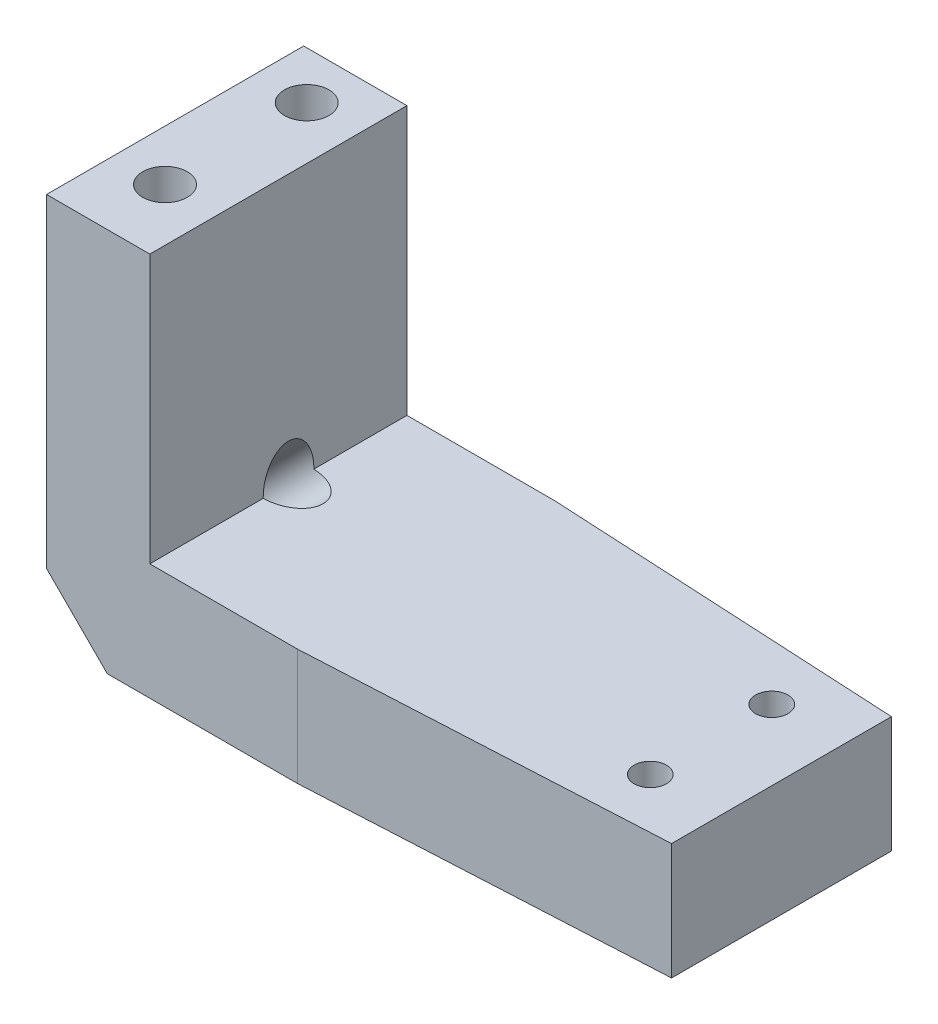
ISO-10303-21;
HEADER;
FILE_DESCRIPTION(('STEP AP214'),'2;1');
FILE_NAME('part.step','',(''),(''),'','','');
FILE_SCHEMA(('AUTOMOTIVE_DESIGN { 1 0 10303 214 1 1 1 1 }'));
ENDSEC;
DATA;
#1=APPLICATION_CONTEXT('core data for automotive mechanical design processes');
#2=APPLICATION_PROTOCOL_DEFINITION('international standard','automotive_design',2000,#1);
#3=PRODUCT_CONTEXT('',#1,'mechanical');
#4=PRODUCT('Part','Part','',(#3));
#5=PRODUCT_RELATED_PRODUCT_CATEGORY('part','',(#4));
#6=PRODUCT_DEFINITION_FORMATION('','',#4);
#7=PRODUCT_DEFINITION_CONTEXT('part definition',#1,'design');
#8=PRODUCT_DEFINITION('design','',#6,#7);
#9=PRODUCT_DEFINITION_SHAPE('','',#8);
#10=(LENGTH_UNIT() NAMED_UNIT(*) SI_UNIT(.MILLI.,.METRE.));
#11=(NAMED_UNIT(*) PLANE_ANGLE_UNIT() SI_UNIT($,.RADIAN.));
#12=(NAMED_UNIT(*) SI_UNIT($,.STERADIAN.) SOLID_ANGLE_UNIT());
#13=UNCERTAINTY_MEASURE_WITH_UNIT(LENGTH_MEASURE(1.E-05),#10,'distance_accuracy_value','');
#14=(GEOMETRIC_REPRESENTATION_CONTEXT(3) GLOBAL_UNCERTAINTY_ASSIGNED_CONTEXT((#13)) GLOBAL_UNIT_ASSIGNED_CONTEXT((#10,
#11,#12)) REPRESENTATION_CONTEXT('',''));
#15=CARTESIAN_POINT('',(0.,0.,0.));
#16=DIRECTION('',(0.,0.,1.));
#17=DIRECTION('',(1.,0.,0.));
#18=AXIS2_PLACEMENT_3D('',#15,#16,#17);
#19=CARTESIAN_POINT('',(29.95,19.,-5.43038701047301));
#20=DIRECTION('',(-0.0523359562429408,0.,0.998629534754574));
#21=DIRECTION('',(0.998629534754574,0.,0.0523359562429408));
#22=AXIS2_PLACEMENT_3D('',#19,#20,#21);
#23=PLANE('',#22);
#24=DIRECTION('',(-0.998629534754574,0.,-0.0523359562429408));
#25=VECTOR('',#24,1.);
#26=CARTESIAN_POINT('',(29.95,0.,-5.43038701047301));
#27=LINE('',#26,#25);
#28=CARTESIAN_POINT('',(29.95,0.,-5.43038701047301));
#29=VERTEX_POINT('',#28);
#30=CARTESIAN_POINT('',(12.402738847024,0.,-6.35));
#31=VERTEX_POINT('',#30);
#32=EDGE_CURVE('E158',#29,#31,#27,.T.);
#33=ORIENTED_EDGE('',*,*,#32,.T.);
#34=DIRECTION('',(0.,-1.,0.));
#35=VECTOR('',#34,1.);
#36=CARTESIAN_POINT('',(12.402738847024,19.,-6.35));
#37=LINE('',#36,#35);
#38=CARTESIAN_POINT('',(12.402738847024,5.75,-6.35));
#39=VERTEX_POINT('',#38);
#40=EDGE_CURVE('E131',#39,#31,#37,.T.);
#41=ORIENTED_EDGE('',*,*,#40,.F.);
#42=DIRECTION('',(0.998629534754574,0.,0.0523359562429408));
#43=VECTOR('',#42,1.);
#44=CARTESIAN_POINT('',(29.95,5.75,-5.43038701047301));
#45=LINE('',#44,#43);
#46=CARTESIAN_POINT('',(29.95,5.75,-5.43038701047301));
#47=VERTEX_POINT('',#46);
#48=EDGE_CURVE('E156',#39,#47,#45,.T.);
#49=ORIENTED_EDGE('',*,*,#48,.T.);
#50=DIRECTION('',(0.,-1.,0.));
#51=VECTOR('',#50,1.);
#52=CARTESIAN_POINT('',(29.95,19.,-5.43038701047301));
#53=LINE('',#52,#51);
#54=EDGE_CURVE('E146',#47,#29,#53,.T.);
#55=ORIENTED_EDGE('',*,*,#54,.T.);
#56=EDGE_LOOP('',(#33,#41,#49,#55));
#57=FACE_BOUND('',#56,.T.);
#58=ADVANCED_FACE('F36',(#57),#23,.F.);
#59=CARTESIAN_POINT('',(0.,19.,-7.));
#60=DIRECTION('',(1.,0.,0.));
#61=DIRECTION('',(0.,0.,-1.));
#62=AXIS2_PLACEMENT_3D('',#59,#60,#61);
#63=PLANE('',#62);
#64=DIRECTION('',(0.,0.,1.));
#65=VECTOR('',#64,1.);
#66=CARTESIAN_POINT('',(0.,19.,-7.));
#67=LINE('',#66,#65);
#68=CARTESIAN_POINT('',(0.,19.,-6.35));
#69=VERTEX_POINT('',#68);
#70=CARTESIAN_POINT('',(0.,19.,6.35));
#71=VERTEX_POINT('',#70);
#72=EDGE_CURVE('E139',#69,#71,#67,.T.);
#73=ORIENTED_EDGE('',*,*,#72,.F.);
#74=DIRECTION('',(0.,-1.,0.));
#75=VECTOR('',#74,1.);
#76=CARTESIAN_POINT('',(0.,19.,-6.35));
#77=LINE('',#76,#75);
#78=CARTESIAN_POINT('',(0.,3.,-6.35));
#79=VERTEX_POINT('',#78);
#80=EDGE_CURVE('E122',#69,#79,#77,.T.);
#81=ORIENTED_EDGE('',*,*,#80,.T.);
#82=DIRECTION('',(0.,0.,1.));
#83=VECTOR('',#82,1.);
#84=CARTESIAN_POINT('',(0.,3.,-7.));
#85=LINE('',#84,#83);
#86=CARTESIAN_POINT('',(0.,3.,6.35));
#87=VERTEX_POINT('',#86);
#88=EDGE_CURVE('E165',#79,#87,#85,.T.);
#89=ORIENTED_EDGE('',*,*,#88,.T.);
#90=DIRECTION('',(0.,-1.,0.));
#91=VECTOR('',#90,1.);
#92=CARTESIAN_POINT('',(0.,19.,6.35));
#93=LINE('',#92,#91);
#94=EDGE_CURVE('E58',#71,#87,#93,.T.);
#95=ORIENTED_EDGE('',*,*,#94,.F.);
#96=EDGE_LOOP('',(#73,#81,#89,#95));
#97=FACE_BOUND('',#96,.T.);
#98=ADVANCED_FACE('F145',(#97),#63,.F.);
#99=CARTESIAN_POINT('',(0.,19.,7.));
#100=DIRECTION('',(-0.0523359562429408,0.,-0.998629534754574));
#101=DIRECTION('',(-0.998629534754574,0.,0.0523359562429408));
#102=AXIS2_PLACEMENT_3D('',#99,#100,#101);
#103=PLANE('',#102);
#104=DIRECTION('',(-0.998629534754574,0.,0.0523359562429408));
#105=VECTOR('',#104,1.);
#106=CARTESIAN_POINT('',(0.,5.75,7.));
#107=LINE('',#106,#105);
#108=CARTESIAN_POINT('',(29.95,5.75,5.43038701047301));
#109=VERTEX_POINT('',#108);
#110=CARTESIAN_POINT('',(12.402738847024,5.75,6.35));
#111=VERTEX_POINT('',#110);
#112=EDGE_CURVE('E229',#109,#111,#107,.T.);
#113=ORIENTED_EDGE('',*,*,#112,.T.);
#114=DIRECTION('',(0.,-1.,0.));
#115=VECTOR('',#114,1.);
#116=CARTESIAN_POINT('',(12.402738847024,19.,6.35));
#117=LINE('',#116,#115);
#118=CARTESIAN_POINT('',(12.402738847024,0.,6.35));
#119=VERTEX_POINT('',#118);
#120=EDGE_CURVE('E250',#111,#119,#117,.T.);
#121=ORIENTED_EDGE('',*,*,#120,.T.);
#122=DIRECTION('',(0.998629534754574,0.,-0.0523359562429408));
#123=VECTOR('',#122,1.);
#124=CARTESIAN_POINT('',(0.,0.,7.));
#125=LINE('',#124,#123);
#126=CARTESIAN_POINT('',(29.95,0.,5.43038701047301));
#127=VERTEX_POINT('',#126);
#128=EDGE_CURVE('E152',#119,#127,#125,.T.);
#129=ORIENTED_EDGE('',*,*,#128,.T.);
#130=DIRECTION('',(0.,-1.,0.));
#131=VECTOR('',#130,1.);
#132=CARTESIAN_POINT('',(29.95,19.,5.43038701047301));
#133=LINE('',#132,#131);
#134=EDGE_CURVE('E149',#109,#127,#133,.T.);
#135=ORIENTED_EDGE('',*,*,#134,.F.);
#136=EDGE_LOOP('',(#113,#121,#129,#135));
#137=FACE_BOUND('',#136,.T.);
#138=ADVANCED_FACE('F300',(#137),#103,.F.);
#139=CARTESIAN_POINT('',(29.95,19.,5.43038701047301));
#140=DIRECTION('',(-1.,0.,0.));
#141=DIRECTION('',(0.,0.,1.));
#142=AXIS2_PLACEMENT_3D('',#139,#140,#141);
#143=PLANE('',#142);
#144=ORIENTED_EDGE('',*,*,#54,.F.);
#145=DIRECTION('',(0.,0.,1.));
#146=VECTOR('',#145,1.);
#147=CARTESIAN_POINT('',(29.95,5.75,-7.));
#148=LINE('',#147,#146);
#149=EDGE_CURVE('E226',#47,#109,#148,.T.);
#150=ORIENTED_EDGE('',*,*,#149,.T.);
#151=ORIENTED_EDGE('',*,*,#134,.T.);
#152=DIRECTION('',(0.,0.,-1.));
#153=VECTOR('',#152,1.);
#154=CARTESIAN_POINT('',(29.95,0.,5.43038701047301));
#155=LINE('',#154,#153);
#156=EDGE_CURVE('E147',#127,#29,#155,.T.);
#157=ORIENTED_EDGE('',*,*,#156,.T.);
#158=EDGE_LOOP('',(#144,#150,#151,#157));
#159=FACE_BOUND('',#158,.T.);
#160=ADVANCED_FACE('F244',(#159),#143,.F.);
#161=CARTESIAN_POINT('',(0.,19.,-7.));
#162=DIRECTION('',(0.,1.,0.));
#163=DIRECTION('',(0.,0.,1.));
#164=AXIS2_PLACEMENT_3D('',#161,#162,#163);
#165=PLANE('',#164);
#166=DIRECTION('',(-1.,0.,0.));
#167=VECTOR('',#166,1.);
#168=CARTESIAN_POINT('',(12.402738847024,19.,-6.35));
#169=LINE('',#168,#167);
#170=CARTESIAN_POINT('',(5.1,19.,-6.35));
#171=VERTEX_POINT('',#170);
#172=EDGE_CURVE('E125',#171,#69,#169,.T.);
#173=ORIENTED_EDGE('',*,*,#172,.T.);
#174=ORIENTED_EDGE('',*,*,#72,.T.);
#175=DIRECTION('',(1.,0.,0.));
#176=VECTOR('',#175,1.);
#177=CARTESIAN_POINT('',(12.402738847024,19.,6.35));
#178=LINE('',#177,#176);
#179=CARTESIAN_POINT('',(5.1,19.,6.35));
#180=VERTEX_POINT('',#179);
#181=EDGE_CURVE('E142',#71,#180,#178,.T.);
#182=ORIENTED_EDGE('',*,*,#181,.T.);
#183=DIRECTION('',(0.,0.,1.));
#184=VECTOR('',#183,1.);
#185=CARTESIAN_POINT('',(5.1,19.,-7.));
#186=LINE('',#185,#184);
#187=EDGE_CURVE('E141',#171,#180,#186,.T.);
#188=ORIENTED_EDGE('',*,*,#187,.F.);
#189=EDGE_LOOP('',(#173,#174,#182,#188));
#190=FACE_BOUND('',#189,.T.);
#191=CARTESIAN_POINT('',(2.5,19.,3.));
#192=DIRECTION('',(0.,-1.,0.));
#193=DIRECTION('',(0.,0.,-1.));
#194=AXIS2_PLACEMENT_3D('',#191,#192,#193);
#195=CIRCLE('',#194,1.1);
#196=CARTESIAN_POINT('',(2.5,19.,1.9));
#197=VERTEX_POINT('',#196);
#198=EDGE_CURVE('E211',#197,#197,#195,.T.);
#199=ORIENTED_EDGE('',*,*,#198,.T.);
#200=EDGE_LOOP('',(#199));
#201=FACE_BOUND('',#200,.T.);
#202=CARTESIAN_POINT('',(2.5,19.,-4.));
#203=DIRECTION('',(0.,-1.,0.));
#204=DIRECTION('',(0.,0.,-1.));
#205=AXIS2_PLACEMENT_3D('',#202,#203,#204);
#206=CIRCLE('',#205,1.1);
#207=CARTESIAN_POINT('',(2.5,19.,-5.1));
#208=VERTEX_POINT('',#207);
#209=EDGE_CURVE('E222',#208,#208,#206,.T.);
#210=ORIENTED_EDGE('',*,*,#209,.T.);
#211=EDGE_LOOP('',(#210));
#212=FACE_BOUND('',#211,.T.);
#213=ADVANCED_FACE('F136',(#190,#201,#212),#165,.T.);
#214=CARTESIAN_POINT('',(0.,0.,-7.));
#215=DIRECTION('',(0.,1.,0.));
#216=DIRECTION('',(0.,0.,1.));
#217=AXIS2_PLACEMENT_3D('',#214,#215,#216);
#218=PLANE('',#217);
#219=CARTESIAN_POINT('',(26.4684792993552,0.,3.));
#220=DIRECTION('',(0.,-1.,0.));
#221=DIRECTION('',(0.,0.,-1.));
#222=AXIS2_PLACEMENT_3D('',#219,#220,#221);
#223=CIRCLE('',#222,0.799999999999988);
#224=CARTESIAN_POINT('',(26.4684792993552,0.,2.20000000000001));
#225=VERTEX_POINT('',#224);
#226=EDGE_CURVE('E272',#225,#225,#223,.T.);
#227=ORIENTED_EDGE('',*,*,#226,.F.);
#228=EDGE_LOOP('',(#227));
#229=FACE_BOUND('',#228,.T.);
#230=CARTESIAN_POINT('',(26.4684792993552,0.,-3.));
#231=DIRECTION('',(0.,-1.,0.));
#232=DIRECTION('',(0.,0.,-1.));
#233=AXIS2_PLACEMENT_3D('',#230,#231,#232);
#234=CIRCLE('',#233,0.799999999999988);
#235=CARTESIAN_POINT('',(26.4684792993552,0.,-3.79999999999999));
#236=VERTEX_POINT('',#235);
#237=EDGE_CURVE('E205',#236,#236,#234,.T.);
#238=ORIENTED_EDGE('',*,*,#237,.F.);
#239=EDGE_LOOP('',(#238));
#240=FACE_BOUND('',#239,.T.);
#241=DIRECTION('',(0.,0.,-1.));
#242=VECTOR('',#241,1.);
#243=CARTESIAN_POINT('',(3.00000000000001,0.,-7.));
#244=LINE('',#243,#242);
#245=CARTESIAN_POINT('',(3.00000000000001,0.,-5.9880895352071));
#246=VERTEX_POINT('',#245);
#247=CARTESIAN_POINT('',(3.00000000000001,0.,-6.35));
#248=VERTEX_POINT('',#247);
#249=EDGE_CURVE('E167',#246,#248,#244,.T.);
#250=ORIENTED_EDGE('',*,*,#249,.T.);
#251=DIRECTION('',(-1.,0.,0.));
#252=VECTOR('',#251,1.);
#253=CARTESIAN_POINT('',(12.402738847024,0.,-6.35));
#254=LINE('',#253,#252);
#255=EDGE_CURVE('E50',#31,#248,#254,.T.);
#256=ORIENTED_EDGE('',*,*,#255,.F.);
#257=ORIENTED_EDGE('',*,*,#32,.F.);
#258=ORIENTED_EDGE('',*,*,#156,.F.);
#259=ORIENTED_EDGE('',*,*,#128,.F.);
#260=DIRECTION('',(1.,0.,0.));
#261=VECTOR('',#260,1.);
#262=CARTESIAN_POINT('',(12.402738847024,0.,6.35));
#263=LINE('',#262,#261);
#264=CARTESIAN_POINT('',(3.00000000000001,0.,6.35));
#265=VERTEX_POINT('',#264);
#266=EDGE_CURVE('E143',#265,#119,#263,.T.);
#267=ORIENTED_EDGE('',*,*,#266,.F.);
#268=DIRECTION('',(0.,0.,-1.));
#269=VECTOR('',#268,1.);
#270=CARTESIAN_POINT('',(3.00000000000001,0.,-7.));
#271=LINE('',#270,#269);
#272=CARTESIAN_POINT('',(3.00000000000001,0.,4.9880895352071));
#273=VERTEX_POINT('',#272);
#274=EDGE_CURVE('E172',#265,#273,#271,.T.);
#275=ORIENTED_EDGE('',*,*,#274,.T.);
#276=CARTESIAN_POINT('',(2.5,0.,3.));
#277=DIRECTION('',(0.,-1.,0.));
#278=DIRECTION('',(0.,0.,-1.));
#279=AXIS2_PLACEMENT_3D('',#276,#277,#278);
#280=CIRCLE('',#279,2.05);
#281=CARTESIAN_POINT('',(3.00000000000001,0.,1.0119104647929));
#282=VERTEX_POINT('',#281);
#283=EDGE_CURVE('E195',#282,#273,#280,.T.);
#284=ORIENTED_EDGE('',*,*,#283,.F.);
#285=DIRECTION('',(0.,0.,-1.));
#286=VECTOR('',#285,1.);
#287=CARTESIAN_POINT('',(3.00000000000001,0.,-7.));
#288=LINE('',#287,#286);
#289=CARTESIAN_POINT('',(3.00000000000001,0.,-2.0119104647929));
#290=VERTEX_POINT('',#289);
#291=EDGE_CURVE('E170',#282,#290,#288,.T.);
#292=ORIENTED_EDGE('',*,*,#291,.T.);
#293=CARTESIAN_POINT('',(2.5,0.,-4.));
#294=DIRECTION('',(0.,-1.,0.));
#295=DIRECTION('',(0.,0.,-1.));
#296=AXIS2_PLACEMENT_3D('',#293,#294,#295);
#297=CIRCLE('',#296,2.05);
#298=EDGE_CURVE('E214',#246,#290,#297,.T.);
#299=ORIENTED_EDGE('',*,*,#298,.F.);
#300=EDGE_LOOP('',(#250,#256,#257,#258,#259,#267,#275,#284,#292,#299));
#301=FACE_BOUND('',#300,.T.);
#302=ADVANCED_FACE('F184',(#229,#240,#301),#218,.F.);
#303=CARTESIAN_POINT('',(5.1,5.75,-7.));
#304=DIRECTION('',(0.,-1.,0.));
#305=DIRECTION('',(0.,0.,-1.));
#306=AXIS2_PLACEMENT_3D('',#303,#304,#305);
#307=PLANE('',#306);
#308=CARTESIAN_POINT('',(26.4684792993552,5.75,3.));
#309=DIRECTION('',(0.,-1.,0.));
#310=DIRECTION('',(0.,0.,-1.));
#311=AXIS2_PLACEMENT_3D('',#308,#309,#310);
#312=CIRCLE('',#311,0.799999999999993);
#313=CARTESIAN_POINT('',(26.4684792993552,5.75,2.20000000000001));
#314=VERTEX_POINT('',#313);
#315=EDGE_CURVE('E275',#314,#314,#312,.T.);
#316=ORIENTED_EDGE('',*,*,#315,.T.);
#317=EDGE_LOOP('',(#316));
#318=FACE_BOUND('',#317,.T.);
#319=CARTESIAN_POINT('',(26.4684792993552,5.75,-3.));
#320=DIRECTION('',(0.,-1.,0.));
#321=DIRECTION('',(0.,0.,-1.));
#322=AXIS2_PLACEMENT_3D('',#319,#320,#321);
#323=CIRCLE('',#322,0.799999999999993);
#324=CARTESIAN_POINT('',(26.4684792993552,5.75,-3.79999999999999));
#325=VERTEX_POINT('',#324);
#326=EDGE_CURVE('E199',#325,#325,#323,.T.);
#327=ORIENTED_EDGE('',*,*,#326,.T.);
#328=EDGE_LOOP('',(#327));
#329=FACE_BOUND('',#328,.T.);
#330=ORIENTED_EDGE('',*,*,#48,.F.);
#331=DIRECTION('',(-1.,0.,0.));
#332=VECTOR('',#331,1.);
#333=CARTESIAN_POINT('',(5.1,5.75,-6.35));
#334=LINE('',#333,#332);
#335=CARTESIAN_POINT('',(5.1,5.75,-6.35));
#336=VERTEX_POINT('',#335);
#337=EDGE_CURVE('E261',#39,#336,#334,.T.);
#338=ORIENTED_EDGE('',*,*,#337,.T.);
#339=DIRECTION('',(0.,0.,1.));
#340=VECTOR('',#339,1.);
#341=CARTESIAN_POINT('',(5.1,5.75,-7.));
#342=LINE('',#341,#340);
#343=CARTESIAN_POINT('',(5.1,5.75,-1.74934759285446));
#344=VERTEX_POINT('',#343);
#345=EDGE_CURVE('E230',#336,#344,#342,.T.);
#346=ORIENTED_EDGE('',*,*,#345,.T.);
#347=CARTESIAN_POINT('',(5.04289321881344,5.75,-0.5));
#348=DIRECTION('',(0.,-1.,0.));
#349=DIRECTION('',(-1.,0.,0.));
#350=AXIS2_PLACEMENT_3D('',#347,#348,#349);
#351=ELLIPSE('',#350,1.76776695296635,1.24999999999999);
#352=CARTESIAN_POINT('',(5.1,5.75,0.74934759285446));
#353=VERTEX_POINT('',#352);
#354=EDGE_CURVE('E266',#344,#353,#351,.T.);
#355=ORIENTED_EDGE('',*,*,#354,.T.);
#356=CARTESIAN_POINT('',(5.1,5.75,6.35));
#357=VERTEX_POINT('',#356);
#358=EDGE_CURVE('E225',#353,#357,#342,.T.);
#359=ORIENTED_EDGE('',*,*,#358,.T.);
#360=DIRECTION('',(1.,0.,0.));
#361=VECTOR('',#360,1.);
#362=CARTESIAN_POINT('',(5.1,5.75,6.35));
#363=LINE('',#362,#361);
#364=EDGE_CURVE('E257',#357,#111,#363,.T.);
#365=ORIENTED_EDGE('',*,*,#364,.T.);
#366=ORIENTED_EDGE('',*,*,#112,.F.);
#367=ORIENTED_EDGE('',*,*,#149,.F.);
#368=EDGE_LOOP('',(#330,#338,#346,#355,#359,#365,#366,#367));
#369=FACE_BOUND('',#368,.T.);
#370=ADVANCED_FACE('F241',(#318,#329,#369),#307,.F.);
#371=CARTESIAN_POINT('',(5.1,5.75,-7.));
#372=DIRECTION('',(-1.,0.,0.));
#373=DIRECTION('',(0.,0.,1.));
#374=AXIS2_PLACEMENT_3D('',#371,#372,#373);
#375=PLANE('',#374);
#376=ORIENTED_EDGE('',*,*,#345,.F.);
#377=DIRECTION('',(0.,1.,0.));
#378=VECTOR('',#377,1.);
#379=CARTESIAN_POINT('',(5.1,5.75,-6.35));
#380=LINE('',#379,#378);
#381=EDGE_CURVE('E259',#336,#171,#380,.T.);
#382=ORIENTED_EDGE('',*,*,#381,.T.);
#383=ORIENTED_EDGE('',*,*,#187,.T.);
#384=DIRECTION('',(0.,-1.,0.));
#385=VECTOR('',#384,1.);
#386=CARTESIAN_POINT('',(5.1,5.75,6.35));
#387=LINE('',#386,#385);
#388=EDGE_CURVE('E254',#180,#357,#387,.T.);
#389=ORIENTED_EDGE('',*,*,#388,.T.);
#390=ORIENTED_EDGE('',*,*,#358,.F.);
#391=CARTESIAN_POINT('',(5.1,5.80710678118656,-0.5));
#392=DIRECTION('',(-1.,0.,0.));
#393=DIRECTION('',(0.,-1.,0.));
#394=AXIS2_PLACEMENT_3D('',#391,#392,#393);
#395=ELLIPSE('',#394,1.76776695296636,1.24999999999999);
#396=EDGE_CURVE('E269',#353,#344,#395,.T.);
#397=ORIENTED_EDGE('',*,*,#396,.T.);
#398=EDGE_LOOP('',(#376,#382,#383,#389,#390,#397));
#399=FACE_BOUND('',#398,.T.);
#400=ADVANCED_FACE('F290',(#399),#375,.F.);
#401=CARTESIAN_POINT('',(2.5,0.,-4.));
#402=DIRECTION('',(0.,-1.,0.));
#403=DIRECTION('',(0.,0.,-1.));
#404=AXIS2_PLACEMENT_3D('',#401,#402,#403);
#405=CYLINDRICAL_SURFACE('',#404,1.1);
#406=ORIENTED_EDGE('',*,*,#209,.F.);
#407=EDGE_LOOP('',(#406));
#408=FACE_BOUND('',#407,.T.);
#409=CARTESIAN_POINT('',(2.5,15.,-4.));
#410=DIRECTION('',(0.,-1.,0.));
#411=DIRECTION('',(0.,0.,-1.));
#412=AXIS2_PLACEMENT_3D('',#409,#410,#411);
#413=CIRCLE('',#412,1.1);
#414=CARTESIAN_POINT('',(2.5,15.,-5.1));
#415=VERTEX_POINT('',#414);
#416=EDGE_CURVE('E219',#415,#415,#413,.T.);
#417=ORIENTED_EDGE('',*,*,#416,.T.);
#418=EDGE_LOOP('',(#417));
#419=FACE_BOUND('',#418,.T.);
#420=ADVANCED_FACE('F336',(#408,#419),#405,.F.);
#421=CARTESIAN_POINT('',(3.6,15.,-4.));
#422=DIRECTION('',(0.,1.,0.));
#423=DIRECTION('',(0.,0.,1.));
#424=AXIS2_PLACEMENT_3D('',#421,#422,#423);
#425=PLANE('',#424);
#426=ORIENTED_EDGE('',*,*,#416,.F.);
#427=EDGE_LOOP('',(#426));
#428=FACE_BOUND('',#427,.T.);
#429=CARTESIAN_POINT('',(2.5,15.,-4.));
#430=DIRECTION('',(0.,-1.,0.));
#431=DIRECTION('',(0.,0.,-1.));
#432=AXIS2_PLACEMENT_3D('',#429,#430,#431);
#433=CIRCLE('',#432,2.05);
#434=CARTESIAN_POINT('',(2.5,15.,-6.05));
#435=VERTEX_POINT('',#434);
#436=EDGE_CURVE('E216',#435,#435,#433,.T.);
#437=ORIENTED_EDGE('',*,*,#436,.T.);
#438=EDGE_LOOP('',(#437));
#439=FACE_BOUND('',#438,.T.);
#440=ADVANCED_FACE('F393',(#428,#439),#425,.F.);
#441=CARTESIAN_POINT('',(2.5,0.,-4.));
#442=DIRECTION('',(0.,-1.,0.));
#443=DIRECTION('',(0.,0.,-1.));
#444=AXIS2_PLACEMENT_3D('',#441,#442,#443);
#445=CYLINDRICAL_SURFACE('',#444,2.05);
#446=ORIENTED_EDGE('',*,*,#436,.F.);
#447=EDGE_LOOP('',(#446));
#448=FACE_BOUND('',#447,.T.);
#449=ORIENTED_EDGE('',*,*,#298,.T.);
#450=CARTESIAN_POINT('',(2.5,0.500000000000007,-4.));
#451=DIRECTION('',(0.707106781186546,0.707106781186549,0.));
#452=DIRECTION('',(0.707106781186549,-0.707106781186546,0.));
#453=AXIS2_PLACEMENT_3D('',#450,#451,#452);
#454=ELLIPSE('',#453,2.89913780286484,2.05);
#455=EDGE_CURVE('E176',#290,#246,#454,.F.);
#456=ORIENTED_EDGE('',*,*,#455,.T.);
#457=EDGE_LOOP('',(#449,#456));
#458=FACE_BOUND('',#457,.T.);
#459=ADVANCED_FACE('F389',(#448,#458),#445,.F.);
#460=CARTESIAN_POINT('',(2.5,0.,3.));
#461=DIRECTION('',(0.,-1.,0.));
#462=DIRECTION('',(0.,0.,-1.));
#463=AXIS2_PLACEMENT_3D('',#460,#461,#462);
#464=CYLINDRICAL_SURFACE('',#463,1.1);
#465=ORIENTED_EDGE('',*,*,#198,.F.);
#466=EDGE_LOOP('',(#465));
#467=FACE_BOUND('',#466,.T.);
#468=CARTESIAN_POINT('',(2.5,15.,3.));
#469=DIRECTION('',(0.,-1.,0.));
#470=DIRECTION('',(0.,0.,-1.));
#471=AXIS2_PLACEMENT_3D('',#468,#469,#470);
#472=CIRCLE('',#471,1.1);
#473=CARTESIAN_POINT('',(2.5,15.,1.9));
#474=VERTEX_POINT('',#473);
#475=EDGE_CURVE('E202',#474,#474,#472,.T.);
#476=ORIENTED_EDGE('',*,*,#475,.T.);
#477=EDGE_LOOP('',(#476));
#478=FACE_BOUND('',#477,.T.);
#479=ADVANCED_FACE('F385',(#467,#478),#464,.F.);
#480=CARTESIAN_POINT('',(3.6,15.,3.));
#481=DIRECTION('',(0.,1.,0.));
#482=DIRECTION('',(0.,0.,1.));
#483=AXIS2_PLACEMENT_3D('',#480,#481,#482);
#484=PLANE('',#483);
#485=ORIENTED_EDGE('',*,*,#475,.F.);
#486=EDGE_LOOP('',(#485));
#487=FACE_BOUND('',#486,.T.);
#488=CARTESIAN_POINT('',(2.5,15.,3.));
#489=DIRECTION('',(0.,-1.,0.));
#490=DIRECTION('',(0.,0.,-1.));
#491=AXIS2_PLACEMENT_3D('',#488,#489,#490);
#492=CIRCLE('',#491,2.05);
#493=CARTESIAN_POINT('',(2.5,15.,0.950000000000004));
#494=VERTEX_POINT('',#493);
#495=EDGE_CURVE('E198',#494,#494,#492,.T.);
#496=ORIENTED_EDGE('',*,*,#495,.T.);
#497=EDGE_LOOP('',(#496));
#498=FACE_BOUND('',#497,.T.);
#499=ADVANCED_FACE('F381',(#487,#498),#484,.F.);
#500=CARTESIAN_POINT('',(2.5,0.,3.));
#501=DIRECTION('',(0.,-1.,0.));
#502=DIRECTION('',(0.,0.,-1.));
#503=AXIS2_PLACEMENT_3D('',#500,#501,#502);
#504=CYLINDRICAL_SURFACE('',#503,2.05);
#505=ORIENTED_EDGE('',*,*,#495,.F.);
#506=EDGE_LOOP('',(#505));
#507=FACE_BOUND('',#506,.T.);
#508=ORIENTED_EDGE('',*,*,#283,.T.);
#509=CARTESIAN_POINT('',(2.5,0.500000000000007,3.));
#510=DIRECTION('',(0.707106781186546,0.707106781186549,0.));
#511=DIRECTION('',(0.707106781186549,-0.707106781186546,0.));
#512=AXIS2_PLACEMENT_3D('',#509,#510,#511);
#513=ELLIPSE('',#512,2.89913780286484,2.05);
#514=EDGE_CURVE('E174',#273,#282,#513,.F.);
#515=ORIENTED_EDGE('',*,*,#514,.T.);
#516=EDGE_LOOP('',(#508,#515));
#517=FACE_BOUND('',#516,.T.);
#518=ADVANCED_FACE('F194',(#507,#517),#504,.F.);
#519=CARTESIAN_POINT('',(26.4684792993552,0.,-3.));
#520=DIRECTION('',(0.,-1.,0.));
#521=DIRECTION('',(0.,0.,-1.));
#522=AXIS2_PLACEMENT_3D('',#519,#520,#521);
#523=CYLINDRICAL_SURFACE('',#522,0.799999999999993);
#524=ORIENTED_EDGE('',*,*,#237,.T.);
#525=EDGE_LOOP('',(#524));
#526=FACE_BOUND('',#525,.T.);
#527=ORIENTED_EDGE('',*,*,#326,.F.);
#528=EDGE_LOOP('',(#527));
#529=FACE_BOUND('',#528,.T.);
#530=ADVANCED_FACE('F280',(#526,#529),#523,.F.);
#531=CARTESIAN_POINT('',(26.4684792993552,0.,3.));
#532=DIRECTION('',(0.,-1.,0.));
#533=DIRECTION('',(0.,0.,-1.));
#534=AXIS2_PLACEMENT_3D('',#531,#532,#533);
#535=CYLINDRICAL_SURFACE('',#534,0.799999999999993);
#536=ORIENTED_EDGE('',*,*,#226,.T.);
#537=EDGE_LOOP('',(#536));
#538=FACE_BOUND('',#537,.T.);
#539=ORIENTED_EDGE('',*,*,#315,.F.);
#540=EDGE_LOOP('',(#539));
#541=FACE_BOUND('',#540,.T.);
#542=ADVANCED_FACE('F349',(#538,#541),#535,.F.);
#543=CARTESIAN_POINT('',(0.,3.,-7.));
#544=DIRECTION('',(0.707106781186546,0.707106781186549,0.));
#545=DIRECTION('',(0.,0.,1.));
#546=AXIS2_PLACEMENT_3D('',#543,#544,#545);
#547=PLANE('',#546);
#548=DIRECTION('',(0.707106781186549,-0.707106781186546,0.));
#549=VECTOR('',#548,1.);
#550=CARTESIAN_POINT('',(0.,3.,-6.35));
#551=LINE('',#550,#549);
#552=EDGE_CURVE('E12',#248,#79,#551,.F.);
#553=ORIENTED_EDGE('',*,*,#552,.F.);
#554=ORIENTED_EDGE('',*,*,#249,.F.);
#555=ORIENTED_EDGE('',*,*,#455,.F.);
#556=ORIENTED_EDGE('',*,*,#291,.F.);
#557=ORIENTED_EDGE('',*,*,#514,.F.);
#558=ORIENTED_EDGE('',*,*,#274,.F.);
#559=DIRECTION('',(-0.707106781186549,0.707106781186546,0.));
#560=VECTOR('',#559,1.);
#561=CARTESIAN_POINT('',(0.,3.,6.35));
#562=LINE('',#561,#560);
#563=EDGE_CURVE('E44',#87,#265,#562,.F.);
#564=ORIENTED_EDGE('',*,*,#563,.F.);
#565=ORIENTED_EDGE('',*,*,#88,.F.);
#566=EDGE_LOOP('',(#553,#554,#555,#556,#557,#558,#564,#565));
#567=FACE_BOUND('',#566,.T.);
#568=CARTESIAN_POINT('',(1.14644660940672,1.85355339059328,-0.5));
#569=DIRECTION('',(-0.707106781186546,-0.707106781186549,0.));
#570=DIRECTION('',(0.707106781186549,-0.707106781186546,0.));
#571=AXIS2_PLACEMENT_3D('',#568,#569,#570);
#572=CIRCLE('',#571,1.24999999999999);
#573=CARTESIAN_POINT('',(2.0303300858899,0.969669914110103,-0.5));
#574=VERTEX_POINT('',#573);
#575=EDGE_CURVE('E263',#574,#574,#572,.T.);
#576=ORIENTED_EDGE('',*,*,#575,.F.);
#577=EDGE_LOOP('',(#576));
#578=FACE_BOUND('',#577,.T.);
#579=ADVANCED_FACE('F38',(#567,#578),#547,.F.);
#580=CARTESIAN_POINT('',(1.14644660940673,1.85355339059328,-0.5));
#581=DIRECTION('',(-0.707106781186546,-0.707106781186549,0.));
#582=DIRECTION('',(0.707106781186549,-0.707106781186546,0.));
#583=AXIS2_PLACEMENT_3D('',#580,#581,#582);
#584=CYLINDRICAL_SURFACE('',#583,1.24999999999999);
#585=ORIENTED_EDGE('',*,*,#575,.T.);
#586=EDGE_LOOP('',(#585));
#587=FACE_BOUND('',#586,.T.);
#588=ORIENTED_EDGE('',*,*,#354,.F.);
#589=ORIENTED_EDGE('',*,*,#396,.F.);
#590=EDGE_LOOP('',(#588,#589));
#591=FACE_BOUND('',#590,.T.);
#592=ADVANCED_FACE('F348',(#587,#591),#584,.F.);
#593=CARTESIAN_POINT('',(12.402738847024,19.,6.35));
#594=DIRECTION('',(0.,0.,-1.));
#595=DIRECTION('',(-1.,0.,0.));
#596=AXIS2_PLACEMENT_3D('',#593,#594,#595);
#597=PLANE('',#596);
#598=ORIENTED_EDGE('',*,*,#388,.F.);
#599=ORIENTED_EDGE('',*,*,#181,.F.);
#600=ORIENTED_EDGE('',*,*,#94,.T.);
#601=ORIENTED_EDGE('',*,*,#563,.T.);
#602=ORIENTED_EDGE('',*,*,#266,.T.);
#603=ORIENTED_EDGE('',*,*,#120,.F.);
#604=ORIENTED_EDGE('',*,*,#364,.F.);
#605=EDGE_LOOP('',(#598,#599,#600,#601,#602,#603,#604));
#606=FACE_BOUND('',#605,.T.);
#607=ADVANCED_FACE('F178',(#606),#597,.F.);
#608=CARTESIAN_POINT('',(12.402738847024,19.,-6.35));
#609=DIRECTION('',(0.,0.,1.));
#610=DIRECTION('',(1.,0.,0.));
#611=AXIS2_PLACEMENT_3D('',#608,#609,#610);
#612=PLANE('',#611);
#613=ORIENTED_EDGE('',*,*,#40,.T.);
#614=ORIENTED_EDGE('',*,*,#255,.T.);
#615=ORIENTED_EDGE('',*,*,#552,.T.);
#616=ORIENTED_EDGE('',*,*,#80,.F.);
#617=ORIENTED_EDGE('',*,*,#172,.F.);
#618=ORIENTED_EDGE('',*,*,#381,.F.);
#619=ORIENTED_EDGE('',*,*,#337,.F.);
#620=EDGE_LOOP('',(#613,#614,#615,#616,#617,#618,#619));
#621=FACE_BOUND('',#620,.T.);
#622=ADVANCED_FACE('F124',(#621),#612,.F.);
#623=CLOSED_SHELL('',(#58,#98,#138,#160,#213,#302,#370,#400,#420,#440,#459,#479,#499,#518,#530,
#542,#579,#592,#607,#622));
#624=MANIFOLD_SOLID_BREP('B2',#623);
#625=ADVANCED_BREP_SHAPE_REPRESENTATION('',(#18,#624),#14);
#626=SHAPE_DEFINITION_REPRESENTATION(#9,#625);
ENDSEC;
END-ISO-10303-21;
